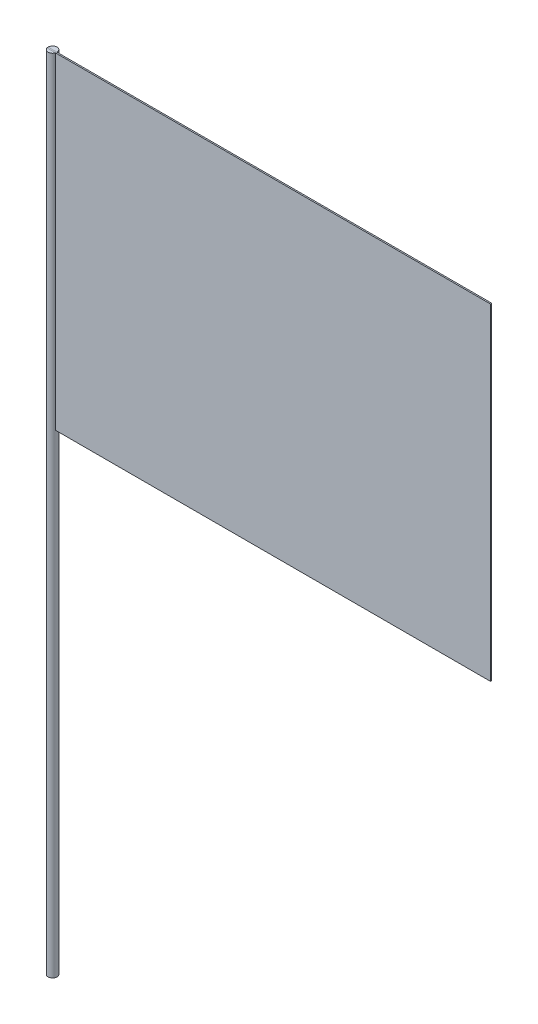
from build123d import *

# Parameters (mm, degrees)
SKETCH1_R      = 5.08
EXTRUDE1_DEPTH = 914.4
SKETCH2_W      = 506.560306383
SKETCH2_H      = 373.153021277
EXTRUDE2_DEPTH = 1.524


with BuildPart() as part:
    # Sketch1 → Extrude1 (new body)
    with BuildSketch(Plane(origin=(0, 0, 0), x_dir=(1, 0, 0), z_dir=(0, 1, 0))):
        with Locations(Location((0, 0, 0), (0, 0, 270))):
            Circle(SKETCH1_R)
    extrude(amount=EXTRUDE1_DEPTH)


with BuildPart() as body_2:
    # Sketch2 → Extrude2 (new body)
    with BuildSketch(Plane.XY):
        with Locations((248.200153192, 727.823489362)):
            Rectangle(SKETCH2_W, SKETCH2_H)
    extrude(amount=EXTRUDE2_DEPTH)


solid = Compound([part.part, body_2.part])
